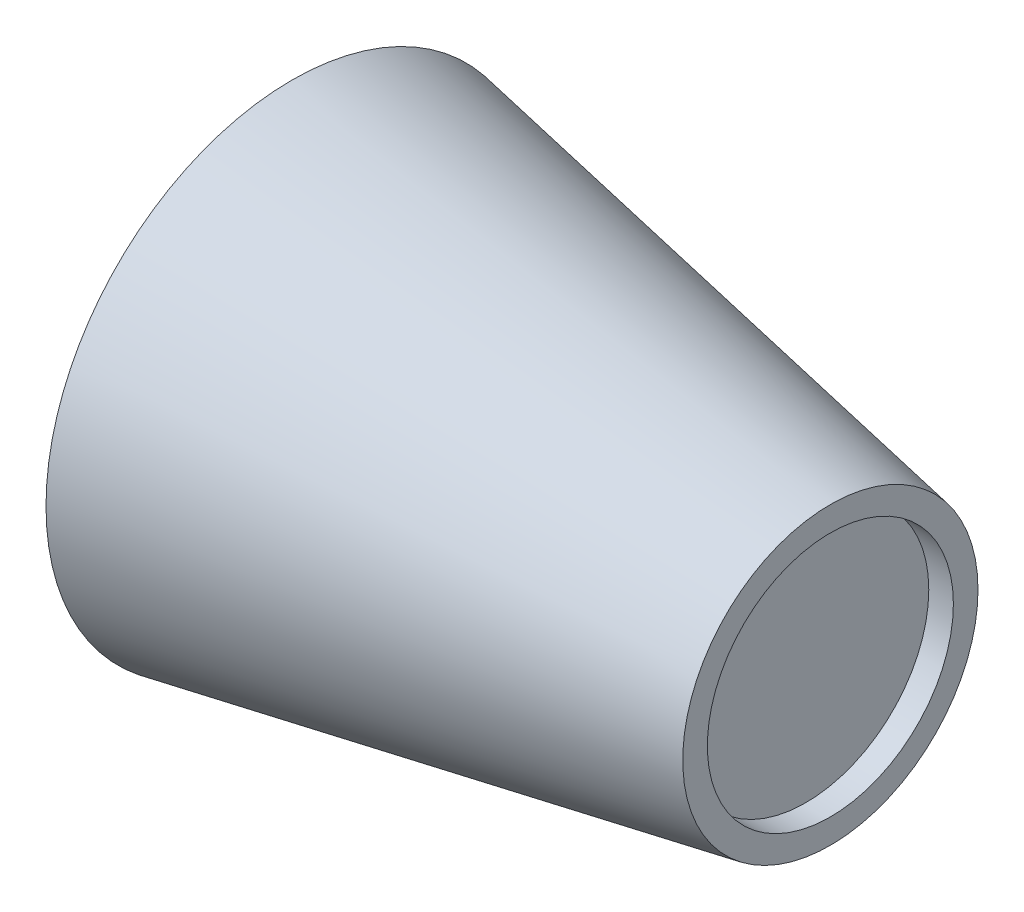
from build123d import *


with BuildPart() as part:
    # Sketch1 → Revolve1 (revolve)
    with BuildSketch(Plane(origin=(0, 0, 0), x_dir=(1, 0, 0), z_dir=(0, 1, 0))):
        Polygon((21.88, 34.834457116), (21.88, 35.834457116), (0, 39.834457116), (0, 33.009457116), (15.88, 33.009457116), (15.88, 29.834457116), (20.88, 29.834457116), (20.88, 34.834457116), align=None)
    revolve(axis=Axis((20.88, 0, -29.834457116), (-1, 0, 0)))


solid = part.part
